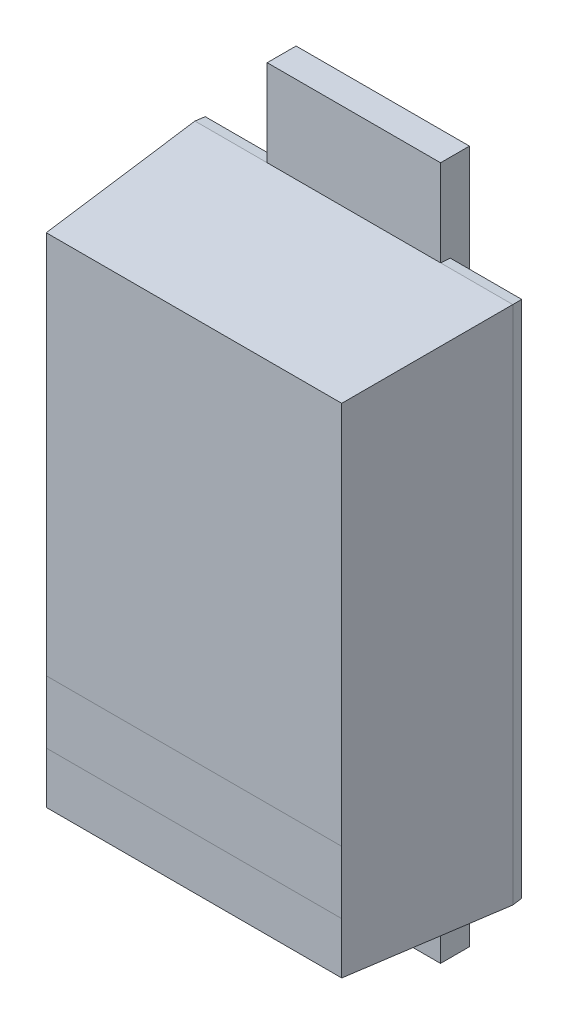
ISO-10303-21;
HEADER;
FILE_DESCRIPTION(('STEP AP214'),'2;1');
FILE_NAME('part.step','',(''),(''),'','','');
FILE_SCHEMA(('AUTOMOTIVE_DESIGN { 1 0 10303 214 1 1 1 1 }'));
ENDSEC;
DATA;
#1=APPLICATION_CONTEXT('core data for automotive mechanical design processes');
#2=APPLICATION_PROTOCOL_DEFINITION('international standard','automotive_design',2000,#1);
#3=PRODUCT_CONTEXT('',#1,'mechanical');
#4=PRODUCT('Part','Part','',(#3));
#5=PRODUCT_RELATED_PRODUCT_CATEGORY('part','',(#4));
#6=PRODUCT_DEFINITION_FORMATION('','',#4);
#7=PRODUCT_DEFINITION_CONTEXT('part definition',#1,'design');
#8=PRODUCT_DEFINITION('design','',#6,#7);
#9=PRODUCT_DEFINITION_SHAPE('','',#8);
#10=(LENGTH_UNIT() NAMED_UNIT(*) SI_UNIT(.MILLI.,.METRE.));
#11=(NAMED_UNIT(*) PLANE_ANGLE_UNIT() SI_UNIT($,.RADIAN.));
#12=(NAMED_UNIT(*) SI_UNIT($,.STERADIAN.) SOLID_ANGLE_UNIT());
#13=UNCERTAINTY_MEASURE_WITH_UNIT(LENGTH_MEASURE(1.E-05),#10,'distance_accuracy_value','');
#14=(GEOMETRIC_REPRESENTATION_CONTEXT(3) GLOBAL_UNCERTAINTY_ASSIGNED_CONTEXT((#13)) GLOBAL_UNIT_ASSIGNED_CONTEXT((#10,
#11,#12)) REPRESENTATION_CONTEXT('',''));
#15=CARTESIAN_POINT('',(0.,0.,0.));
#16=DIRECTION('',(0.,0.,1.));
#17=DIRECTION('',(1.,0.,0.));
#18=AXIS2_PLACEMENT_3D('',#15,#16,#17);
#19=CARTESIAN_POINT('',(16.5001000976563,44.4,0.93));
#20=DIRECTION('',(0.,0.,1.));
#21=DIRECTION('',(1.,0.,0.));
#22=AXIS2_PLACEMENT_3D('',#19,#20,#21);
#23=PLANE('',#22);
#24=DIRECTION('',(-1.,0.,0.));
#25=VECTOR('',#24,1.);
#26=CARTESIAN_POINT('',(15.7331393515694,43.7,0.93));
#27=LINE('',#26,#25);
#28=CARTESIAN_POINT('',(17.2670608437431,43.7,0.93));
#29=VERTEX_POINT('',#28);
#30=CARTESIAN_POINT('',(15.7331393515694,43.7,0.93));
#31=VERTEX_POINT('',#30);
#32=EDGE_CURVE('P0_E161',#29,#31,#27,.T.);
#33=ORIENTED_EDGE('',*,*,#32,.T.);
#34=DIRECTION('',(0.,1.,0.));
#35=VECTOR('',#34,1.);
#36=CARTESIAN_POINT('',(15.7331393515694,44.4,0.93));
#37=LINE('',#36,#35);
#38=CARTESIAN_POINT('',(15.7331393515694,43.375,0.93));
#39=VERTEX_POINT('',#38);
#40=EDGE_CURVE('P0_E148',#31,#39,#37,.F.);
#41=ORIENTED_EDGE('',*,*,#40,.T.);
#42=DIRECTION('',(1.,0.,0.));
#43=VECTOR('',#42,1.);
#44=CARTESIAN_POINT('',(15.7331393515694,43.375,0.93));
#45=LINE('',#44,#43);
#46=CARTESIAN_POINT('',(17.2670608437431,43.375,0.93));
#47=VERTEX_POINT('',#46);
#48=EDGE_CURVE('P0_E156',#39,#47,#45,.T.);
#49=ORIENTED_EDGE('',*,*,#48,.T.);
#50=DIRECTION('',(0.,1.,0.));
#51=VECTOR('',#50,1.);
#52=CARTESIAN_POINT('',(17.2670608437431,44.4,0.93));
#53=LINE('',#52,#51);
#54=EDGE_CURVE('P0_E20',#47,#29,#53,.T.);
#55=ORIENTED_EDGE('',*,*,#54,.T.);
#56=EDGE_LOOP('',(#33,#41,#49,#55));
#57=FACE_BOUND('',#56,.T.);
#58=ADVANCED_FACE('P0_F17',(#57),#23,.T.);
#59=CARTESIAN_POINT('',(15.7331393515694,43.375,0.93));
#60=DIRECTION('',(0.,-1.,0.));
#61=DIRECTION('',(1.,0.,0.));
#62=AXIS2_PLACEMENT_3D('',#59,#60,#61);
#63=PLANE('',#62);
#64=DIRECTION('',(0.,0.,1.));
#65=VECTOR('',#64,1.);
#66=CARTESIAN_POINT('',(17.2670608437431,43.375,0.93));
#67=LINE('',#66,#65);
#68=CARTESIAN_POINT('',(17.2670608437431,43.375,0.980000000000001));
#69=VERTEX_POINT('',#68);
#70=EDGE_CURVE('P0_E164',#47,#69,#67,.T.);
#71=ORIENTED_EDGE('',*,*,#70,.F.);
#72=ORIENTED_EDGE('',*,*,#48,.F.);
#73=DIRECTION('',(0.,0.,1.));
#74=VECTOR('',#73,1.);
#75=CARTESIAN_POINT('',(15.7331393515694,43.375,0.93));
#76=LINE('',#75,#74);
#77=CARTESIAN_POINT('',(15.7331393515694,43.375,0.98));
#78=VERTEX_POINT('',#77);
#79=EDGE_CURVE('P0_E144',#78,#39,#76,.F.);
#80=ORIENTED_EDGE('',*,*,#79,.F.);
#81=DIRECTION('',(-1.,0.,0.));
#82=VECTOR('',#81,1.);
#83=CARTESIAN_POINT('',(17.3251000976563,43.375,0.98));
#84=LINE('',#83,#82);
#85=EDGE_CURVE('P0_E173',#78,#69,#84,.F.);
#86=ORIENTED_EDGE('',*,*,#85,.T.);
#87=EDGE_LOOP('',(#71,#72,#80,#86));
#88=FACE_BOUND('',#87,.T.);
#89=ADVANCED_FACE('P0_F163',(#88),#63,.F.);
#90=CARTESIAN_POINT('',(15.7331393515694,43.7,0.93));
#91=DIRECTION('',(0.,1.,0.));
#92=DIRECTION('',(-1.,0.,0.));
#93=AXIS2_PLACEMENT_3D('',#90,#91,#92);
#94=PLANE('',#93);
#95=DIRECTION('',(0.,0.,1.));
#96=VECTOR('',#95,1.);
#97=CARTESIAN_POINT('',(15.7331393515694,43.7,0.93));
#98=LINE('',#97,#96);
#99=CARTESIAN_POINT('',(15.7331393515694,43.7,0.98));
#100=VERTEX_POINT('',#99);
#101=EDGE_CURVE('P0_E177',#100,#31,#98,.F.);
#102=ORIENTED_EDGE('',*,*,#101,.T.);
#103=ORIENTED_EDGE('',*,*,#32,.F.);
#104=DIRECTION('',(0.,0.,1.));
#105=VECTOR('',#104,1.);
#106=CARTESIAN_POINT('',(17.2670608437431,43.7,0.93));
#107=LINE('',#106,#105);
#108=CARTESIAN_POINT('',(17.2670608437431,43.7,0.980000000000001));
#109=VERTEX_POINT('',#108);
#110=EDGE_CURVE('P0_E166',#109,#29,#107,.F.);
#111=ORIENTED_EDGE('',*,*,#110,.F.);
#112=DIRECTION('',(-1.,0.,0.));
#113=VECTOR('',#112,1.);
#114=CARTESIAN_POINT('',(17.3251000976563,43.7,0.98));
#115=LINE('',#114,#113);
#116=EDGE_CURVE('P0_E185',#109,#100,#115,.T.);
#117=ORIENTED_EDGE('',*,*,#116,.T.);
#118=EDGE_LOOP('',(#102,#103,#111,#117));
#119=FACE_BOUND('',#118,.T.);
#120=ADVANCED_FACE('P0_F375',(#119),#94,.F.);
#121=CARTESIAN_POINT('',(17.3251000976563,43.05,0.98));
#122=DIRECTION('',(0.,0.,-1.));
#123=DIRECTION('',(-1.,0.,0.));
#124=AXIS2_PLACEMENT_3D('',#121,#122,#123);
#125=PLANE('',#124);
#126=ORIENTED_EDGE('',*,*,#85,.F.);
#127=DIRECTION('',(0.,1.,0.));
#128=VECTOR('',#127,1.);
#129=CARTESIAN_POINT('',(15.7331393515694,43.05,0.98));
#130=LINE('',#129,#128);
#131=CARTESIAN_POINT('',(15.7331393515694,43.1080392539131,0.98));
#132=VERTEX_POINT('',#131);
#133=EDGE_CURVE('P0_E171',#132,#78,#130,.T.);
#134=ORIENTED_EDGE('',*,*,#133,.F.);
#135=DIRECTION('',(1.,0.,0.));
#136=VECTOR('',#135,1.);
#137=CARTESIAN_POINT('',(17.3251000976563,43.1080392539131,0.979999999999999));
#138=LINE('',#137,#136);
#139=CARTESIAN_POINT('',(17.2670608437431,43.1080392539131,0.980000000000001));
#140=VERTEX_POINT('',#139);
#141=EDGE_CURVE('P0_E187',#132,#140,#138,.T.);
#142=ORIENTED_EDGE('',*,*,#141,.T.);
#143=DIRECTION('',(0.,1.,0.));
#144=VECTOR('',#143,1.);
#145=CARTESIAN_POINT('',(17.2670608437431,43.05,0.98));
#146=LINE('',#145,#144);
#147=EDGE_CURVE('P0_E175',#69,#140,#146,.F.);
#148=ORIENTED_EDGE('',*,*,#147,.F.);
#149=EDGE_LOOP('',(#126,#134,#142,#148));
#150=FACE_BOUND('',#149,.T.);
#151=ADVANCED_FACE('P0_F373',(#150),#125,.F.);
#152=CARTESIAN_POINT('',(15.7331393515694,43.375,0.93));
#153=DIRECTION('',(-1.,0.,0.));
#154=DIRECTION('',(0.,0.,1.));
#155=AXIS2_PLACEMENT_3D('',#152,#153,#154);
#156=PLANE('',#155);
#157=ORIENTED_EDGE('',*,*,#79,.T.);
#158=ORIENTED_EDGE('',*,*,#40,.F.);
#159=ORIENTED_EDGE('',*,*,#101,.F.);
#160=DIRECTION('',(0.,1.,0.));
#161=VECTOR('',#160,1.);
#162=CARTESIAN_POINT('',(15.7331393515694,43.05,0.98));
#163=LINE('',#162,#161);
#164=EDGE_CURVE('P0_E151',#100,#78,#163,.F.);
#165=ORIENTED_EDGE('',*,*,#164,.T.);
#166=EDGE_LOOP('',(#157,#158,#159,#165));
#167=FACE_BOUND('',#166,.T.);
#168=ADVANCED_FACE('P0_F146',(#167),#156,.F.);
#169=CARTESIAN_POINT('',(17.3251000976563,45.6919607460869,0.98));
#170=DIRECTION('',(0.,-0.997564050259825,-0.0697564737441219));
#171=DIRECTION('',(0.,0.0697564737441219,-0.997564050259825));
#172=AXIS2_PLACEMENT_3D('',#169,#170,#171);
#173=PLANE('',#172);
#174=DIRECTION('',(1.,0.,0.));
#175=VECTOR('',#174,1.);
#176=CARTESIAN_POINT('',(17.3251000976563,45.75,0.14999999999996));
#177=LINE('',#176,#175);
#178=CARTESIAN_POINT('',(16.9501000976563,45.75,0.149999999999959));
#179=VERTEX_POINT('',#178);
#180=CARTESIAN_POINT('',(17.3251000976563,45.75,0.14999999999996));
#181=VERTEX_POINT('',#180);
#182=EDGE_CURVE('P0_E181',#179,#181,#177,.T.);
#183=ORIENTED_EDGE('',*,*,#182,.F.);
#184=DIRECTION('',(1.,0.,0.));
#185=VECTOR('',#184,1.);
#186=CARTESIAN_POINT('',(16.5001000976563,45.75,0.149999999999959));
#187=LINE('',#186,#185);
#188=CARTESIAN_POINT('',(16.0501000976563,45.75,0.149999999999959));
#189=VERTEX_POINT('',#188);
#190=EDGE_CURVE('P0_E203',#179,#189,#187,.F.);
#191=ORIENTED_EDGE('',*,*,#190,.T.);
#192=DIRECTION('',(1.,0.,0.));
#193=VECTOR('',#192,1.);
#194=CARTESIAN_POINT('',(17.3251000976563,45.75,0.149999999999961));
#195=LINE('',#194,#193);
#196=CARTESIAN_POINT('',(15.6751000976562,45.75,0.149999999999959));
#197=VERTEX_POINT('',#196);
#198=EDGE_CURVE('P0_E179',#197,#189,#195,.T.);
#199=ORIENTED_EDGE('',*,*,#198,.F.);
#200=DIRECTION('',(0.0695873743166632,-0.0695873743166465,0.99514581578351));
#201=VECTOR('',#200,1.);
#202=CARTESIAN_POINT('',(15.6751000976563,45.75,0.149999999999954));
#203=LINE('',#202,#201);
#204=CARTESIAN_POINT('',(15.7331393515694,45.6919607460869,0.98));
#205=VERTEX_POINT('',#204);
#206=EDGE_CURVE('P0_E194',#197,#205,#203,.T.);
#207=ORIENTED_EDGE('',*,*,#206,.T.);
#208=DIRECTION('',(-1.,0.,0.));
#209=VECTOR('',#208,1.);
#210=CARTESIAN_POINT('',(17.3251000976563,45.6919607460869,0.98));
#211=LINE('',#210,#209);
#212=CARTESIAN_POINT('',(17.2670608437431,45.6919607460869,0.980000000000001));
#213=VERTEX_POINT('',#212);
#214=EDGE_CURVE('P0_E183',#205,#213,#211,.F.);
#215=ORIENTED_EDGE('',*,*,#214,.T.);
#216=DIRECTION('',(-0.0695873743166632,-0.0695873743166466,0.99514581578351));
#217=VECTOR('',#216,1.);
#218=CARTESIAN_POINT('',(17.3251000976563,45.75,0.14999999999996));
#219=LINE('',#218,#217);
#220=EDGE_CURVE('P0_E209',#181,#213,#219,.T.);
#221=ORIENTED_EDGE('',*,*,#220,.F.);
#222=EDGE_LOOP('',(#183,#191,#199,#207,#215,#221));
#223=FACE_BOUND('',#222,.T.);
#224=ADVANCED_FACE('P0_F367',(#223),#173,.F.);
#225=CARTESIAN_POINT('',(17.3251000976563,43.05,0.98));
#226=DIRECTION('',(0.,0.,-1.));
#227=DIRECTION('',(-1.,0.,0.));
#228=AXIS2_PLACEMENT_3D('',#225,#226,#227);
#229=PLANE('',#228);
#230=ORIENTED_EDGE('',*,*,#116,.F.);
#231=DIRECTION('',(0.,1.,0.));
#232=VECTOR('',#231,1.);
#233=CARTESIAN_POINT('',(17.2670608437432,44.4,0.980000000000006));
#234=LINE('',#233,#232);
#235=EDGE_CURVE('P0_E212',#213,#109,#234,.F.);
#236=ORIENTED_EDGE('',*,*,#235,.F.);
#237=ORIENTED_EDGE('',*,*,#214,.F.);
#238=DIRECTION('',(0.,1.,0.));
#239=VECTOR('',#238,1.);
#240=CARTESIAN_POINT('',(15.7331393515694,43.05,0.98));
#241=LINE('',#240,#239);
#242=EDGE_CURVE('P0_E196',#205,#100,#241,.F.);
#243=ORIENTED_EDGE('',*,*,#242,.T.);
#244=EDGE_LOOP('',(#230,#236,#237,#243));
#245=FACE_BOUND('',#244,.T.);
#246=ADVANCED_FACE('P0_F371',(#245),#229,.F.);
#247=CARTESIAN_POINT('',(17.2670608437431,43.375,0.93));
#248=DIRECTION('',(1.,0.,0.));
#249=DIRECTION('',(0.,0.,-1.));
#250=AXIS2_PLACEMENT_3D('',#247,#248,#249);
#251=PLANE('',#250);
#252=ORIENTED_EDGE('',*,*,#110,.T.);
#253=ORIENTED_EDGE('',*,*,#54,.F.);
#254=ORIENTED_EDGE('',*,*,#70,.T.);
#255=DIRECTION('',(0.,1.,0.));
#256=VECTOR('',#255,1.);
#257=CARTESIAN_POINT('',(17.2670608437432,44.4,0.980000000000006));
#258=LINE('',#257,#256);
#259=EDGE_CURVE('P0_E215',#109,#69,#258,.F.);
#260=ORIENTED_EDGE('',*,*,#259,.F.);
#261=EDGE_LOOP('',(#252,#253,#254,#260));
#262=FACE_BOUND('',#261,.T.);
#263=ADVANCED_FACE('P0_F426',(#262),#251,.F.);
#264=CARTESIAN_POINT('',(17.3251000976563,43.05,0.14999999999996));
#265=DIRECTION('',(0.,0.997564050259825,-0.0697564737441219));
#266=DIRECTION('',(0.,0.0697564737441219,0.997564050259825));
#267=AXIS2_PLACEMENT_3D('',#264,#265,#266);
#268=PLANE('',#267);
#269=DIRECTION('',(1.,0.,0.));
#270=VECTOR('',#269,1.);
#271=CARTESIAN_POINT('',(17.3251000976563,43.05,0.14999999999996));
#272=LINE('',#271,#270);
#273=CARTESIAN_POINT('',(16.0501000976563,43.05,0.14999999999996));
#274=VERTEX_POINT('',#273);
#275=CARTESIAN_POINT('',(15.6751000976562,43.05,0.149999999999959));
#276=VERTEX_POINT('',#275);
#277=EDGE_CURVE('P0_E192',#274,#276,#272,.F.);
#278=ORIENTED_EDGE('',*,*,#277,.F.);
#279=DIRECTION('',(1.,0.,0.));
#280=VECTOR('',#279,1.);
#281=CARTESIAN_POINT('',(16.5001000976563,43.05,0.149999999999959));
#282=LINE('',#281,#280);
#283=CARTESIAN_POINT('',(16.9501000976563,43.05,0.14999999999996));
#284=VERTEX_POINT('',#283);
#285=EDGE_CURVE('P0_E218',#274,#284,#282,.T.);
#286=ORIENTED_EDGE('',*,*,#285,.T.);
#287=DIRECTION('',(1.,0.,0.));
#288=VECTOR('',#287,1.);
#289=CARTESIAN_POINT('',(17.3251000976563,43.05,0.149999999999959));
#290=LINE('',#289,#288);
#291=CARTESIAN_POINT('',(17.3251000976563,43.05,0.149999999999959));
#292=VERTEX_POINT('',#291);
#293=EDGE_CURVE('P0_E190',#292,#284,#290,.F.);
#294=ORIENTED_EDGE('',*,*,#293,.F.);
#295=DIRECTION('',(0.0695873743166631,-0.0695873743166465,-0.99514581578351));
#296=VECTOR('',#295,1.);
#297=CARTESIAN_POINT('',(17.2670608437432,43.1080392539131,0.980000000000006));
#298=LINE('',#297,#296);
#299=EDGE_CURVE('P0_E206',#140,#292,#298,.T.);
#300=ORIENTED_EDGE('',*,*,#299,.F.);
#301=ORIENTED_EDGE('',*,*,#141,.F.);
#302=DIRECTION('',(-0.0695873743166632,-0.0695873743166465,-0.99514581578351));
#303=VECTOR('',#302,1.);
#304=CARTESIAN_POINT('',(15.7331393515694,43.1080392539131,0.98));
#305=LINE('',#304,#303);
#306=EDGE_CURVE('P0_E200',#132,#276,#305,.T.);
#307=ORIENTED_EDGE('',*,*,#306,.T.);
#308=EDGE_LOOP('',(#278,#286,#294,#300,#301,#307));
#309=FACE_BOUND('',#308,.T.);
#310=ADVANCED_FACE('P0_F308',(#309),#268,.F.);
#311=CARTESIAN_POINT('',(15.7331393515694,43.05,0.98));
#312=DIRECTION('',(0.997564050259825,0.,-0.0697564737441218));
#313=DIRECTION('',(-0.0697564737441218,0.,-0.997564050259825));
#314=AXIS2_PLACEMENT_3D('',#311,#312,#313);
#315=PLANE('',#314);
#316=ORIENTED_EDGE('',*,*,#133,.T.);
#317=ORIENTED_EDGE('',*,*,#164,.F.);
#318=ORIENTED_EDGE('',*,*,#242,.F.);
#319=ORIENTED_EDGE('',*,*,#206,.F.);
#320=DIRECTION('',(0.,1.,0.));
#321=VECTOR('',#320,1.);
#322=CARTESIAN_POINT('',(15.6751000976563,43.05,0.149999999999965));
#323=LINE('',#322,#321);
#324=EDGE_CURVE('P0_E225',#197,#276,#323,.F.);
#325=ORIENTED_EDGE('',*,*,#324,.T.);
#326=ORIENTED_EDGE('',*,*,#306,.F.);
#327=EDGE_LOOP('',(#316,#317,#318,#319,#325,#326));
#328=FACE_BOUND('',#327,.T.);
#329=ADVANCED_FACE('P0_F362',(#328),#315,.F.);
#330=CARTESIAN_POINT('',(16.5001000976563,44.4,0.149999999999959));
#331=DIRECTION('',(0.,0.,1.));
#332=DIRECTION('',(0.,-1.,0.));
#333=AXIS2_PLACEMENT_3D('',#330,#331,#332);
#334=PLANE('',#333);
#335=DIRECTION('',(1.,0.,0.));
#336=VECTOR('',#335,1.);
#337=CARTESIAN_POINT('',(16.9501000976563,45.45,0.149999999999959));
#338=LINE('',#337,#336);
#339=CARTESIAN_POINT('',(16.9501000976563,45.45,0.149999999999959));
#340=VERTEX_POINT('',#339);
#341=CARTESIAN_POINT('',(16.0501000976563,45.45,0.149999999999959));
#342=VERTEX_POINT('',#341);
#343=EDGE_CURVE('P0_E237',#340,#342,#338,.F.);
#344=ORIENTED_EDGE('',*,*,#343,.T.);
#345=DIRECTION('',(0.,-1.,0.));
#346=VECTOR('',#345,1.);
#347=CARTESIAN_POINT('',(16.0501000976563,45.45,0.149999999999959));
#348=LINE('',#347,#346);
#349=EDGE_CURVE('P0_E232',#342,#189,#348,.F.);
#350=ORIENTED_EDGE('',*,*,#349,.T.);
#351=ORIENTED_EDGE('',*,*,#190,.F.);
#352=DIRECTION('',(0.,1.,0.));
#353=VECTOR('',#352,1.);
#354=CARTESIAN_POINT('',(16.9501000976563,45.45,0.149999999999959));
#355=LINE('',#354,#353);
#356=EDGE_CURVE('P0_E241',#179,#340,#355,.F.);
#357=ORIENTED_EDGE('',*,*,#356,.T.);
#358=EDGE_LOOP('',(#344,#350,#351,#357));
#359=FACE_BOUND('',#358,.T.);
#360=ADVANCED_FACE('P0_F418',(#359),#334,.F.);
#361=CARTESIAN_POINT('',(17.3251000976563,44.4,0.14999999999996));
#362=DIRECTION('',(0.997564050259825,0.,0.0697564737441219));
#363=DIRECTION('',(0.0697564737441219,0.,-0.997564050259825));
#364=AXIS2_PLACEMENT_3D('',#361,#362,#363);
#365=PLANE('',#364);
#366=ORIENTED_EDGE('',*,*,#259,.T.);
#367=ORIENTED_EDGE('',*,*,#147,.T.);
#368=ORIENTED_EDGE('',*,*,#299,.T.);
#369=DIRECTION('',(0.,1.,0.));
#370=VECTOR('',#369,1.);
#371=CARTESIAN_POINT('',(17.3251000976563,44.4,0.14999999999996));
#372=LINE('',#371,#370);
#373=EDGE_CURVE('P0_E250',#181,#292,#372,.F.);
#374=ORIENTED_EDGE('',*,*,#373,.F.);
#375=ORIENTED_EDGE('',*,*,#220,.T.);
#376=ORIENTED_EDGE('',*,*,#235,.T.);
#377=EDGE_LOOP('',(#366,#367,#368,#374,#375,#376));
#378=FACE_BOUND('',#377,.T.);
#379=ADVANCED_FACE('P0_F356',(#378),#365,.T.);
#380=CARTESIAN_POINT('',(16.5001000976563,44.4,0.149999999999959));
#381=DIRECTION('',(0.,0.,1.));
#382=DIRECTION('',(0.,-1.,0.));
#383=AXIS2_PLACEMENT_3D('',#380,#381,#382);
#384=PLANE('',#383);
#385=DIRECTION('',(0.,1.,0.));
#386=VECTOR('',#385,1.);
#387=CARTESIAN_POINT('',(16.9501000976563,43.35,0.14999999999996));
#388=LINE('',#387,#386);
#389=CARTESIAN_POINT('',(16.9501000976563,43.35,0.149999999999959));
#390=VERTEX_POINT('',#389);
#391=EDGE_CURVE('P0_E255',#390,#284,#388,.F.);
#392=ORIENTED_EDGE('',*,*,#391,.T.);
#393=ORIENTED_EDGE('',*,*,#285,.F.);
#394=DIRECTION('',(0.,-1.,0.));
#395=VECTOR('',#394,1.);
#396=CARTESIAN_POINT('',(16.0501000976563,43.35,0.14999999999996));
#397=LINE('',#396,#395);
#398=CARTESIAN_POINT('',(16.0501000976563,43.35,0.14999999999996));
#399=VERTEX_POINT('',#398);
#400=EDGE_CURVE('P0_E221',#274,#399,#397,.F.);
#401=ORIENTED_EDGE('',*,*,#400,.T.);
#402=DIRECTION('',(1.,0.,0.));
#403=VECTOR('',#402,1.);
#404=CARTESIAN_POINT('',(16.9501000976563,43.35,0.149999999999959));
#405=LINE('',#404,#403);
#406=EDGE_CURVE('P0_E263',#399,#390,#405,.T.);
#407=ORIENTED_EDGE('',*,*,#406,.T.);
#408=EDGE_LOOP('',(#392,#393,#401,#407));
#409=FACE_BOUND('',#408,.T.);
#410=ADVANCED_FACE('P0_F311',(#409),#384,.F.);
#411=CARTESIAN_POINT('',(16.0501000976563,43.35,0.149999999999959));
#412=DIRECTION('',(-1.,0.,0.));
#413=DIRECTION('',(0.,-1.,0.));
#414=AXIS2_PLACEMENT_3D('',#411,#412,#413);
#415=PLANE('',#414);
#416=DIRECTION('',(0.,1.,0.));
#417=VECTOR('',#416,1.);
#418=CARTESIAN_POINT('',(16.0501000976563,44.4,0.1));
#419=LINE('',#418,#417);
#420=CARTESIAN_POINT('',(16.0501000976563,43.35,0.1));
#421=VERTEX_POINT('',#420);
#422=CARTESIAN_POINT('',(16.0501000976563,43.0534963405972,0.099999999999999));
#423=VERTEX_POINT('',#422);
#424=EDGE_CURVE('P0_E266',#421,#423,#419,.F.);
#425=ORIENTED_EDGE('',*,*,#424,.F.);
#426=DIRECTION('',(0.,0.,1.));
#427=VECTOR('',#426,1.);
#428=CARTESIAN_POINT('',(16.0501000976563,43.35,0.14999999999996));
#429=LINE('',#428,#427);
#430=EDGE_CURVE('P0_E260',#421,#399,#429,.T.);
#431=ORIENTED_EDGE('',*,*,#430,.T.);
#432=ORIENTED_EDGE('',*,*,#400,.F.);
#433=DIRECTION('',(0.,-0.069756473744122,0.997564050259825));
#434=VECTOR('',#433,1.);
#435=CARTESIAN_POINT('',(16.0501000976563,43.0604890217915,0.));
#436=LINE('',#435,#434);
#437=EDGE_CURVE('P0_E223',#274,#423,#436,.F.);
#438=ORIENTED_EDGE('',*,*,#437,.T.);
#439=EDGE_LOOP('',(#425,#431,#432,#438));
#440=FACE_BOUND('',#439,.T.);
#441=ADVANCED_FACE('P0_F317',(#440),#415,.F.);
#442=CARTESIAN_POINT('',(17.3251000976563,43.0604890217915,0.));
#443=DIRECTION('',(0.,0.997564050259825,0.069756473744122));
#444=DIRECTION('',(0.,-0.069756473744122,0.997564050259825));
#445=AXIS2_PLACEMENT_3D('',#442,#443,#444);
#446=PLANE('',#445);
#447=ORIENTED_EDGE('',*,*,#277,.T.);
#448=DIRECTION('',(0.0695873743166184,0.0695873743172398,-0.995145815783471));
#449=VECTOR('',#448,1.);
#450=CARTESIAN_POINT('',(15.6751000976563,43.05,0.149999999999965));
#451=LINE('',#450,#449);
#452=CARTESIAN_POINT('',(15.6785964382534,43.0534963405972,0.099999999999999));
#453=VERTEX_POINT('',#452);
#454=EDGE_CURVE('P0_E228',#276,#453,#451,.T.);
#455=ORIENTED_EDGE('',*,*,#454,.T.);
#456=DIRECTION('',(-1.,0.,0.));
#457=VECTOR('',#456,1.);
#458=CARTESIAN_POINT('',(16.5001000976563,43.0534963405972,0.1));
#459=LINE('',#458,#457);
#460=EDGE_CURVE('P0_E269',#423,#453,#459,.T.);
#461=ORIENTED_EDGE('',*,*,#460,.F.);
#462=ORIENTED_EDGE('',*,*,#437,.F.);
#463=EDGE_LOOP('',(#447,#455,#461,#462));
#464=FACE_BOUND('',#463,.T.);
#465=ADVANCED_FACE('P0_F322',(#464),#446,.F.);
#466=CARTESIAN_POINT('',(15.6855891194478,43.05,0.));
#467=DIRECTION('',(0.997564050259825,0.,0.0697564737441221));
#468=DIRECTION('',(0.0697564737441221,0.,-0.997564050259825));
#469=AXIS2_PLACEMENT_3D('',#466,#467,#468);
#470=PLANE('',#469);
#471=DIRECTION('',(0.,1.,0.));
#472=VECTOR('',#471,1.);
#473=CARTESIAN_POINT('',(15.6785964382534,44.4,0.1));
#474=LINE('',#473,#472);
#475=CARTESIAN_POINT('',(15.6785964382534,45.7465036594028,0.100000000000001));
#476=VERTEX_POINT('',#475);
#477=EDGE_CURVE('P0_E272',#453,#476,#474,.T.);
#478=ORIENTED_EDGE('',*,*,#477,.F.);
#479=ORIENTED_EDGE('',*,*,#454,.F.);
#480=ORIENTED_EDGE('',*,*,#324,.F.);
#481=DIRECTION('',(0.0695873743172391,-0.0695873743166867,-0.995145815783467));
#482=VECTOR('',#481,1.);
#483=CARTESIAN_POINT('',(15.6751000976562,45.75,0.14999999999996));
#484=LINE('',#483,#482);
#485=EDGE_CURVE('P0_E230',#197,#476,#484,.T.);
#486=ORIENTED_EDGE('',*,*,#485,.T.);
#487=EDGE_LOOP('',(#478,#479,#480,#486));
#488=FACE_BOUND('',#487,.T.);
#489=ADVANCED_FACE('P0_F326',(#488),#470,.F.);
#490=CARTESIAN_POINT('',(17.3251000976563,45.75,0.15000000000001));
#491=DIRECTION('',(0.,-0.997564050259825,0.0697564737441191));
#492=DIRECTION('',(0.,-0.0697564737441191,-0.997564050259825));
#493=AXIS2_PLACEMENT_3D('',#490,#491,#492);
#494=PLANE('',#493);
#495=DIRECTION('',(-1.,0.,0.));
#496=VECTOR('',#495,1.);
#497=CARTESIAN_POINT('',(16.5001000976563,45.7465036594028,0.1));
#498=LINE('',#497,#496);
#499=CARTESIAN_POINT('',(16.0501000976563,45.7465036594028,0.0999999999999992));
#500=VERTEX_POINT('',#499);
#501=EDGE_CURVE('P0_E275',#476,#500,#498,.F.);
#502=ORIENTED_EDGE('',*,*,#501,.F.);
#503=ORIENTED_EDGE('',*,*,#485,.F.);
#504=ORIENTED_EDGE('',*,*,#198,.T.);
#505=DIRECTION('',(0.,-0.0697564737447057,-0.997564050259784));
#506=VECTOR('',#505,1.);
#507=CARTESIAN_POINT('',(16.0501000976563,45.75,0.149999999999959));
#508=LINE('',#507,#506);
#509=EDGE_CURVE('P0_E235',#189,#500,#508,.T.);
#510=ORIENTED_EDGE('',*,*,#509,.T.);
#511=EDGE_LOOP('',(#502,#503,#504,#510));
#512=FACE_BOUND('',#511,.T.);
#513=ADVANCED_FACE('P0_F330',(#512),#494,.F.);
#514=CARTESIAN_POINT('',(16.0501000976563,45.45,0.149999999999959));
#515=DIRECTION('',(-1.,0.,0.));
#516=DIRECTION('',(0.,-1.,0.));
#517=AXIS2_PLACEMENT_3D('',#514,#515,#516);
#518=PLANE('',#517);
#519=ORIENTED_EDGE('',*,*,#349,.F.);
#520=DIRECTION('',(0.,0.,-1.));
#521=VECTOR('',#520,1.);
#522=CARTESIAN_POINT('',(16.0501000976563,45.45,0.149999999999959));
#523=LINE('',#522,#521);
#524=CARTESIAN_POINT('',(16.0501000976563,45.45,0.1));
#525=VERTEX_POINT('',#524);
#526=EDGE_CURVE('P0_E239',#342,#525,#523,.T.);
#527=ORIENTED_EDGE('',*,*,#526,.T.);
#528=DIRECTION('',(0.,1.,0.));
#529=VECTOR('',#528,1.);
#530=CARTESIAN_POINT('',(16.0501000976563,44.4,0.1));
#531=LINE('',#530,#529);
#532=EDGE_CURVE('P0_E278',#500,#525,#531,.F.);
#533=ORIENTED_EDGE('',*,*,#532,.F.);
#534=ORIENTED_EDGE('',*,*,#509,.F.);
#535=EDGE_LOOP('',(#519,#527,#533,#534));
#536=FACE_BOUND('',#535,.T.);
#537=ADVANCED_FACE('P0_F336',(#536),#518,.F.);
#538=CARTESIAN_POINT('',(16.9501000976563,45.45,0.149999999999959));
#539=DIRECTION('',(0.,-1.,0.));
#540=DIRECTION('',(0.,0.,-1.));
#541=AXIS2_PLACEMENT_3D('',#538,#539,#540);
#542=PLANE('',#541);
#543=ORIENTED_EDGE('',*,*,#526,.F.);
#544=ORIENTED_EDGE('',*,*,#343,.F.);
#545=DIRECTION('',(0.,0.,1.));
#546=VECTOR('',#545,1.);
#547=CARTESIAN_POINT('',(16.9501000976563,45.45,0.149999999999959));
#548=LINE('',#547,#546);
#549=CARTESIAN_POINT('',(16.9501000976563,45.45,0.1));
#550=VERTEX_POINT('',#549);
#551=EDGE_CURVE('P0_E243',#340,#550,#548,.F.);
#552=ORIENTED_EDGE('',*,*,#551,.T.);
#553=DIRECTION('',(-1.,0.,0.));
#554=VECTOR('',#553,1.);
#555=CARTESIAN_POINT('',(16.5001000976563,45.45,0.1));
#556=LINE('',#555,#554);
#557=EDGE_CURVE('P0_E281',#525,#550,#556,.F.);
#558=ORIENTED_EDGE('',*,*,#557,.F.);
#559=EDGE_LOOP('',(#543,#544,#552,#558));
#560=FACE_BOUND('',#559,.T.);
#561=ADVANCED_FACE('P0_F340',(#560),#542,.F.);
#562=CARTESIAN_POINT('',(16.9501000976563,45.45,0.149999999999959));
#563=DIRECTION('',(1.,0.,0.));
#564=DIRECTION('',(0.,1.,0.));
#565=AXIS2_PLACEMENT_3D('',#562,#563,#564);
#566=PLANE('',#565);
#567=DIRECTION('',(0.,1.,0.));
#568=VECTOR('',#567,1.);
#569=CARTESIAN_POINT('',(16.9501000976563,44.4,0.1));
#570=LINE('',#569,#568);
#571=CARTESIAN_POINT('',(16.9501000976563,45.7465036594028,0.0999999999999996));
#572=VERTEX_POINT('',#571);
#573=EDGE_CURVE('P0_E284',#550,#572,#570,.T.);
#574=ORIENTED_EDGE('',*,*,#573,.F.);
#575=ORIENTED_EDGE('',*,*,#551,.F.);
#576=ORIENTED_EDGE('',*,*,#356,.F.);
#577=DIRECTION('',(0.,-0.0697564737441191,-0.997564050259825));
#578=VECTOR('',#577,1.);
#579=CARTESIAN_POINT('',(16.9501000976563,45.75,0.15000000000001));
#580=LINE('',#579,#578);
#581=EDGE_CURVE('P0_E245',#179,#572,#580,.T.);
#582=ORIENTED_EDGE('',*,*,#581,.T.);
#583=EDGE_LOOP('',(#574,#575,#576,#582));
#584=FACE_BOUND('',#583,.T.);
#585=ADVANCED_FACE('P0_F345',(#584),#566,.F.);
#586=CARTESIAN_POINT('',(17.3251000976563,45.75,0.15000000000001));
#587=DIRECTION('',(0.,-0.997564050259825,0.0697564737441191));
#588=DIRECTION('',(0.,-0.0697564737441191,-0.997564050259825));
#589=AXIS2_PLACEMENT_3D('',#586,#587,#588);
#590=PLANE('',#589);
#591=ORIENTED_EDGE('',*,*,#182,.T.);
#592=DIRECTION('',(0.0695873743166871,0.0695873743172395,0.995145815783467));
#593=VECTOR('',#592,1.);
#594=CARTESIAN_POINT('',(17.3216037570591,45.7465036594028,0.0999999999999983));
#595=LINE('',#594,#593);
#596=CARTESIAN_POINT('',(17.3216037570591,45.7465036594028,0.0999999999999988));
#597=VERTEX_POINT('',#596);
#598=EDGE_CURVE('P0_E247',#597,#181,#595,.T.);
#599=ORIENTED_EDGE('',*,*,#598,.F.);
#600=DIRECTION('',(-1.,0.,0.));
#601=VECTOR('',#600,1.);
#602=CARTESIAN_POINT('',(16.5001000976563,45.7465036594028,0.1));
#603=LINE('',#602,#601);
#604=EDGE_CURVE('P0_E287',#572,#597,#603,.F.);
#605=ORIENTED_EDGE('',*,*,#604,.F.);
#606=ORIENTED_EDGE('',*,*,#581,.F.);
#607=EDGE_LOOP('',(#591,#599,#605,#606));
#608=FACE_BOUND('',#607,.T.);
#609=ADVANCED_FACE('P0_F350',(#608),#590,.F.);
#610=CARTESIAN_POINT('',(17.3251000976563,44.4,0.15000000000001));
#611=DIRECTION('',(0.997564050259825,0.,-0.069756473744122));
#612=DIRECTION('',(-0.069756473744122,0.,-0.997564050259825));
#613=AXIS2_PLACEMENT_3D('',#610,#611,#612);
#614=PLANE('',#613);
#615=ORIENTED_EDGE('',*,*,#598,.T.);
#616=ORIENTED_EDGE('',*,*,#373,.T.);
#617=DIRECTION('',(-0.0695873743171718,0.0695873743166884,-0.995145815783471));
#618=VECTOR('',#617,1.);
#619=CARTESIAN_POINT('',(17.3251000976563,43.05,0.149999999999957));
#620=LINE('',#619,#618);
#621=CARTESIAN_POINT('',(17.3216037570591,43.0534963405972,0.0999999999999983));
#622=VERTEX_POINT('',#621);
#623=EDGE_CURVE('P0_E253',#292,#622,#620,.T.);
#624=ORIENTED_EDGE('',*,*,#623,.T.);
#625=DIRECTION('',(0.,1.,0.));
#626=VECTOR('',#625,1.);
#627=CARTESIAN_POINT('',(17.3216037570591,44.4,0.1));
#628=LINE('',#627,#626);
#629=EDGE_CURVE('P0_E290',#597,#622,#628,.F.);
#630=ORIENTED_EDGE('',*,*,#629,.F.);
#631=EDGE_LOOP('',(#615,#616,#624,#630));
#632=FACE_BOUND('',#631,.T.);
#633=ADVANCED_FACE('P0_F353',(#632),#614,.T.);
#634=CARTESIAN_POINT('',(17.3251000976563,43.0604890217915,0.));
#635=DIRECTION('',(0.,0.997564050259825,0.069756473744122));
#636=DIRECTION('',(0.,-0.069756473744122,0.997564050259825));
#637=AXIS2_PLACEMENT_3D('',#634,#635,#636);
#638=PLANE('',#637);
#639=DIRECTION('',(-1.,0.,0.));
#640=VECTOR('',#639,1.);
#641=CARTESIAN_POINT('',(16.5001000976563,43.0534963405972,0.1));
#642=LINE('',#641,#640);
#643=CARTESIAN_POINT('',(16.9501000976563,43.0534963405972,0.0999999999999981));
#644=VERTEX_POINT('',#643);
#645=EDGE_CURVE('P0_E293',#622,#644,#642,.T.);
#646=ORIENTED_EDGE('',*,*,#645,.F.);
#647=ORIENTED_EDGE('',*,*,#623,.F.);
#648=ORIENTED_EDGE('',*,*,#293,.T.);
#649=DIRECTION('',(0.,0.0697564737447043,-0.997564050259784));
#650=VECTOR('',#649,1.);
#651=CARTESIAN_POINT('',(16.9501000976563,43.05,0.14999999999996));
#652=LINE('',#651,#650);
#653=EDGE_CURVE('P0_E258',#284,#644,#652,.T.);
#654=ORIENTED_EDGE('',*,*,#653,.T.);
#655=EDGE_LOOP('',(#646,#647,#648,#654));
#656=FACE_BOUND('',#655,.T.);
#657=ADVANCED_FACE('P0_F303',(#656),#638,.F.);
#658=CARTESIAN_POINT('',(16.9501000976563,43.35,0.14999999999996));
#659=DIRECTION('',(1.,0.,0.));
#660=DIRECTION('',(0.,1.,0.));
#661=AXIS2_PLACEMENT_3D('',#658,#659,#660);
#662=PLANE('',#661);
#663=ORIENTED_EDGE('',*,*,#391,.F.);
#664=DIRECTION('',(0.,0.,1.));
#665=VECTOR('',#664,1.);
#666=CARTESIAN_POINT('',(16.9501000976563,43.35,0.14999999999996));
#667=LINE('',#666,#665);
#668=CARTESIAN_POINT('',(16.9501000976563,43.35,0.1));
#669=VERTEX_POINT('',#668);
#670=EDGE_CURVE('P0_E35',#390,#669,#667,.F.);
#671=ORIENTED_EDGE('',*,*,#670,.T.);
#672=DIRECTION('',(0.,1.,0.));
#673=VECTOR('',#672,1.);
#674=CARTESIAN_POINT('',(16.9501000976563,44.4,0.1));
#675=LINE('',#674,#673);
#676=EDGE_CURVE('P0_E26',#644,#669,#675,.T.);
#677=ORIENTED_EDGE('',*,*,#676,.F.);
#678=ORIENTED_EDGE('',*,*,#653,.F.);
#679=EDGE_LOOP('',(#663,#671,#677,#678));
#680=FACE_BOUND('',#679,.T.);
#681=ADVANCED_FACE('P0_F301',(#680),#662,.F.);
#682=CARTESIAN_POINT('',(16.9501000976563,43.35,0.14999999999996));
#683=DIRECTION('',(0.,1.,0.));
#684=DIRECTION('',(0.,0.,1.));
#685=AXIS2_PLACEMENT_3D('',#682,#683,#684);
#686=PLANE('',#685);
#687=ORIENTED_EDGE('',*,*,#670,.F.);
#688=ORIENTED_EDGE('',*,*,#406,.F.);
#689=ORIENTED_EDGE('',*,*,#430,.F.);
#690=DIRECTION('',(-1.,0.,0.));
#691=VECTOR('',#690,1.);
#692=CARTESIAN_POINT('',(16.5001000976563,43.35,0.1));
#693=LINE('',#692,#691);
#694=EDGE_CURVE('P0_E11',#669,#421,#693,.T.);
#695=ORIENTED_EDGE('',*,*,#694,.F.);
#696=EDGE_LOOP('',(#687,#688,#689,#695));
#697=FACE_BOUND('',#696,.T.);
#698=ADVANCED_FACE('P0_F315',(#697),#686,.F.);
#699=CARTESIAN_POINT('',(16.5001000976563,44.4,0.1));
#700=DIRECTION('',(0.,0.,-1.));
#701=DIRECTION('',(-1.,0.,0.));
#702=AXIS2_PLACEMENT_3D('',#699,#700,#701);
#703=PLANE('',#702);
#704=ORIENTED_EDGE('',*,*,#676,.T.);
#705=ORIENTED_EDGE('',*,*,#694,.T.);
#706=ORIENTED_EDGE('',*,*,#424,.T.);
#707=ORIENTED_EDGE('',*,*,#460,.T.);
#708=ORIENTED_EDGE('',*,*,#477,.T.);
#709=ORIENTED_EDGE('',*,*,#501,.T.);
#710=ORIENTED_EDGE('',*,*,#532,.T.);
#711=ORIENTED_EDGE('',*,*,#557,.T.);
#712=ORIENTED_EDGE('',*,*,#573,.T.);
#713=ORIENTED_EDGE('',*,*,#604,.T.);
#714=ORIENTED_EDGE('',*,*,#629,.T.);
#715=ORIENTED_EDGE('',*,*,#645,.T.);
#716=EDGE_LOOP('',(#704,#705,#706,#707,#708,#709,#710,#711,#712,#713,#714,#715));
#717=FACE_BOUND('',#716,.T.);
#718=ADVANCED_FACE('P0_F298',(#717),#703,.T.);
#719=CLOSED_SHELL('',(#58,#89,#120,#151,#168,#224,#246,#263,#310,#329,#360,#379,#410,#441,#465,
#489,#513,#537,#561,#585,#609,#633,#657,#681,#698,#718));
#720=MANIFOLD_SOLID_BREP('P0_B1',#719);
#721=CARTESIAN_POINT('',(16.9501000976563,42.6,0.));
#722=DIRECTION('',(0.,0.,1.));
#723=DIRECTION('',(0.,-1.,0.));
#724=AXIS2_PLACEMENT_3D('',#721,#722,#723);
#725=PLANE('',#724);
#726=DIRECTION('',(1.,0.,0.));
#727=VECTOR('',#726,1.);
#728=CARTESIAN_POINT('',(16.9501000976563,43.35,0.));
#729=LINE('',#728,#727);
#730=CARTESIAN_POINT('',(16.0501000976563,43.35,0.));
#731=VERTEX_POINT('',#730);
#732=CARTESIAN_POINT('',(16.9501000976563,43.35,0.));
#733=VERTEX_POINT('',#732);
#734=EDGE_CURVE('P1_E20',#731,#733,#729,.T.);
#735=ORIENTED_EDGE('',*,*,#734,.T.);
#736=DIRECTION('',(0.,1.,0.));
#737=VECTOR('',#736,1.);
#738=CARTESIAN_POINT('',(16.9501000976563,44.4,0.));
#739=LINE('',#738,#737);
#740=CARTESIAN_POINT('',(16.9501000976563,42.6,0.));
#741=VERTEX_POINT('',#740);
#742=EDGE_CURVE('P1_E55',#741,#733,#739,.T.);
#743=ORIENTED_EDGE('',*,*,#742,.F.);
#744=DIRECTION('',(-1.,0.,0.));
#745=VECTOR('',#744,1.);
#746=CARTESIAN_POINT('',(16.9501000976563,42.6,0.));
#747=LINE('',#746,#745);
#748=CARTESIAN_POINT('',(16.0501000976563,42.6,0.));
#749=VERTEX_POINT('',#748);
#750=EDGE_CURVE('P1_E76',#741,#749,#747,.T.);
#751=ORIENTED_EDGE('',*,*,#750,.T.);
#752=DIRECTION('',(0.,1.,0.));
#753=VECTOR('',#752,1.);
#754=CARTESIAN_POINT('',(16.0501000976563,44.4,0.));
#755=LINE('',#754,#753);
#756=EDGE_CURVE('P1_E58',#749,#731,#755,.T.);
#757=ORIENTED_EDGE('',*,*,#756,.T.);
#758=EDGE_LOOP('',(#735,#743,#751,#757));
#759=FACE_BOUND('',#758,.T.);
#760=ADVANCED_FACE('P1_F17',(#759),#725,.F.);
#761=CARTESIAN_POINT('',(16.9501000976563,43.35,0.));
#762=DIRECTION('',(0.,-1.,0.));
#763=DIRECTION('',(1.,0.,0.));
#764=AXIS2_PLACEMENT_3D('',#761,#762,#763);
#765=PLANE('',#764);
#766=DIRECTION('',(1.,0.,0.));
#767=VECTOR('',#766,1.);
#768=CARTESIAN_POINT('',(16.9501000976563,43.35,0.14999999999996));
#769=LINE('',#768,#767);
#770=CARTESIAN_POINT('',(16.0501000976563,43.35,0.14999999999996));
#771=VERTEX_POINT('',#770);
#772=CARTESIAN_POINT('',(16.9501000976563,43.35,0.14999999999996));
#773=VERTEX_POINT('',#772);
#774=EDGE_CURVE('P1_E73',#771,#773,#769,.T.);
#775=ORIENTED_EDGE('',*,*,#774,.T.);
#776=DIRECTION('',(0.,0.,-1.));
#777=VECTOR('',#776,1.);
#778=CARTESIAN_POINT('',(16.9501000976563,43.35,0.));
#779=LINE('',#778,#777);
#780=EDGE_CURVE('P1_E63',#733,#773,#779,.F.);
#781=ORIENTED_EDGE('',*,*,#780,.F.);
#782=ORIENTED_EDGE('',*,*,#734,.F.);
#783=DIRECTION('',(0.,0.,-1.));
#784=VECTOR('',#783,1.);
#785=CARTESIAN_POINT('',(16.0501000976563,43.35,0.));
#786=LINE('',#785,#784);
#787=EDGE_CURVE('P1_E80',#731,#771,#786,.F.);
#788=ORIENTED_EDGE('',*,*,#787,.T.);
#789=EDGE_LOOP('',(#775,#781,#782,#788));
#790=FACE_BOUND('',#789,.T.);
#791=ADVANCED_FACE('P1_F72',(#790),#765,.F.);
#792=CARTESIAN_POINT('',(16.9501000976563,44.4,0.));
#793=DIRECTION('',(1.,0.,0.));
#794=DIRECTION('',(0.,0.,-1.));
#795=AXIS2_PLACEMENT_3D('',#792,#793,#794);
#796=PLANE('',#795);
#797=DIRECTION('',(0.,0.,1.));
#798=VECTOR('',#797,1.);
#799=CARTESIAN_POINT('',(16.9501000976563,42.6,0.14999999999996));
#800=LINE('',#799,#798);
#801=CARTESIAN_POINT('',(16.9501000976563,42.6,0.14999999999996));
#802=VERTEX_POINT('',#801);
#803=EDGE_CURVE('P1_E69',#802,#741,#800,.F.);
#804=ORIENTED_EDGE('',*,*,#803,.T.);
#805=ORIENTED_EDGE('',*,*,#742,.T.);
#806=ORIENTED_EDGE('',*,*,#780,.T.);
#807=DIRECTION('',(0.,1.,0.));
#808=VECTOR('',#807,1.);
#809=CARTESIAN_POINT('',(16.9501000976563,43.35,0.14999999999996));
#810=LINE('',#809,#808);
#811=EDGE_CURVE('P1_E83',#773,#802,#810,.F.);
#812=ORIENTED_EDGE('',*,*,#811,.T.);
#813=EDGE_LOOP('',(#804,#805,#806,#812));
#814=FACE_BOUND('',#813,.T.);
#815=ADVANCED_FACE('P1_F66',(#814),#796,.T.);
#816=CARTESIAN_POINT('',(16.9501000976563,42.6,0.14999999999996));
#817=DIRECTION('',(0.,1.,0.));
#818=DIRECTION('',(-1.,0.,0.));
#819=AXIS2_PLACEMENT_3D('',#816,#817,#818);
#820=PLANE('',#819);
#821=ORIENTED_EDGE('',*,*,#750,.F.);
#822=ORIENTED_EDGE('',*,*,#803,.F.);
#823=DIRECTION('',(1.,0.,0.));
#824=VECTOR('',#823,1.);
#825=CARTESIAN_POINT('',(16.9501000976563,42.6,0.14999999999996));
#826=LINE('',#825,#824);
#827=CARTESIAN_POINT('',(16.0501000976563,42.6,0.14999999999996));
#828=VERTEX_POINT('',#827);
#829=EDGE_CURVE('P1_E26',#802,#828,#826,.F.);
#830=ORIENTED_EDGE('',*,*,#829,.T.);
#831=DIRECTION('',(0.,0.,-1.));
#832=VECTOR('',#831,1.);
#833=CARTESIAN_POINT('',(16.0501000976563,42.6,0.));
#834=LINE('',#833,#832);
#835=EDGE_CURVE('P1_E34',#828,#749,#834,.T.);
#836=ORIENTED_EDGE('',*,*,#835,.T.);
#837=EDGE_LOOP('',(#821,#822,#830,#836));
#838=FACE_BOUND('',#837,.T.);
#839=ADVANCED_FACE('P1_F88',(#838),#820,.F.);
#840=CARTESIAN_POINT('',(16.0501000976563,44.4,0.));
#841=DIRECTION('',(1.,0.,0.));
#842=DIRECTION('',(0.,0.,-1.));
#843=AXIS2_PLACEMENT_3D('',#840,#841,#842);
#844=PLANE('',#843);
#845=ORIENTED_EDGE('',*,*,#756,.F.);
#846=ORIENTED_EDGE('',*,*,#835,.F.);
#847=DIRECTION('',(0.,1.,0.));
#848=VECTOR('',#847,1.);
#849=CARTESIAN_POINT('',(16.0501000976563,43.35,0.14999999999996));
#850=LINE('',#849,#848);
#851=EDGE_CURVE('P1_E11',#828,#771,#850,.T.);
#852=ORIENTED_EDGE('',*,*,#851,.T.);
#853=ORIENTED_EDGE('',*,*,#787,.F.);
#854=EDGE_LOOP('',(#845,#846,#852,#853));
#855=FACE_BOUND('',#854,.T.);
#856=ADVANCED_FACE('P1_F91',(#855),#844,.F.);
#857=CARTESIAN_POINT('',(16.9501000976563,43.35,0.14999999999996));
#858=DIRECTION('',(0.,0.,-1.));
#859=DIRECTION('',(0.,1.,0.));
#860=AXIS2_PLACEMENT_3D('',#857,#858,#859);
#861=PLANE('',#860);
#862=ORIENTED_EDGE('',*,*,#829,.F.);
#863=ORIENTED_EDGE('',*,*,#811,.F.);
#864=ORIENTED_EDGE('',*,*,#774,.F.);
#865=ORIENTED_EDGE('',*,*,#851,.F.);
#866=EDGE_LOOP('',(#862,#863,#864,#865));
#867=FACE_BOUND('',#866,.T.);
#868=ADVANCED_FACE('P1_F90',(#867),#861,.F.);
#869=CLOSED_SHELL('',(#760,#791,#815,#839,#856,#868));
#870=MANIFOLD_SOLID_BREP('P1_B1',#869);
#871=CARTESIAN_POINT('',(16.5001000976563,44.4,0.93));
#872=DIRECTION('',(0.,0.,1.));
#873=DIRECTION('',(1.,0.,0.));
#874=AXIS2_PLACEMENT_3D('',#871,#872,#873);
#875=PLANE('',#874);
#876=DIRECTION('',(0.,1.,0.));
#877=VECTOR('',#876,1.);
#878=CARTESIAN_POINT('',(15.7331393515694,44.4,0.93));
#879=LINE('',#878,#877);
#880=CARTESIAN_POINT('',(15.7331393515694,43.7,0.93));
#881=VERTEX_POINT('',#880);
#882=CARTESIAN_POINT('',(15.7331393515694,43.375,0.93));
#883=VERTEX_POINT('',#882);
#884=EDGE_CURVE('P2_E20',#881,#883,#879,.F.);
#885=ORIENTED_EDGE('',*,*,#884,.F.);
#886=DIRECTION('',(-1.,0.,0.));
#887=VECTOR('',#886,1.);
#888=CARTESIAN_POINT('',(15.7331393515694,43.7,0.93));
#889=LINE('',#888,#887);
#890=CARTESIAN_POINT('',(17.2670608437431,43.7,0.93));
#891=VERTEX_POINT('',#890);
#892=EDGE_CURVE('P2_E55',#891,#881,#889,.T.);
#893=ORIENTED_EDGE('',*,*,#892,.F.);
#894=DIRECTION('',(0.,1.,0.));
#895=VECTOR('',#894,1.);
#896=CARTESIAN_POINT('',(17.2670608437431,43.375,0.93));
#897=LINE('',#896,#895);
#898=CARTESIAN_POINT('',(17.2670608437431,43.375,0.93));
#899=VERTEX_POINT('',#898);
#900=EDGE_CURVE('P2_E58',#899,#891,#897,.T.);
#901=ORIENTED_EDGE('',*,*,#900,.F.);
#902=DIRECTION('',(1.,0.,0.));
#903=VECTOR('',#902,1.);
#904=CARTESIAN_POINT('',(15.7331393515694,43.375,0.93));
#905=LINE('',#904,#903);
#906=EDGE_CURVE('P2_E60',#883,#899,#905,.T.);
#907=ORIENTED_EDGE('',*,*,#906,.F.);
#908=EDGE_LOOP('',(#885,#893,#901,#907));
#909=FACE_BOUND('',#908,.T.);
#910=ADVANCED_FACE('P2_F17',(#909),#875,.F.);
#911=CARTESIAN_POINT('',(15.7331393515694,43.375,-0.637973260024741));
#912=DIRECTION('',(0.,-1.,0.));
#913=DIRECTION('',(1.,0.,0.));
#914=AXIS2_PLACEMENT_3D('',#911,#912,#913);
#915=PLANE('',#914);
#916=DIRECTION('',(1.,0.,0.));
#917=VECTOR('',#916,1.);
#918=CARTESIAN_POINT('',(16.5001000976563,43.375,0.98));
#919=LINE('',#918,#917);
#920=CARTESIAN_POINT('',(15.7331393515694,43.375,0.98));
#921=VERTEX_POINT('',#920);
#922=CARTESIAN_POINT('',(17.2670608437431,43.375,0.98));
#923=VERTEX_POINT('',#922);
#924=EDGE_CURVE('P2_E83',#921,#923,#919,.T.);
#925=ORIENTED_EDGE('',*,*,#924,.F.);
#926=DIRECTION('',(0.,0.,1.));
#927=VECTOR('',#926,1.);
#928=CARTESIAN_POINT('',(15.7331393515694,43.375,-0.637973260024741));
#929=LINE('',#928,#927);
#930=EDGE_CURVE('P2_E71',#883,#921,#929,.T.);
#931=ORIENTED_EDGE('',*,*,#930,.F.);
#932=ORIENTED_EDGE('',*,*,#906,.T.);
#933=DIRECTION('',(0.,0.,-1.));
#934=VECTOR('',#933,1.);
#935=CARTESIAN_POINT('',(17.2670608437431,43.375,-0.637973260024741));
#936=LINE('',#935,#934);
#937=EDGE_CURVE('P2_E65',#923,#899,#936,.T.);
#938=ORIENTED_EDGE('',*,*,#937,.F.);
#939=EDGE_LOOP('',(#925,#931,#932,#938));
#940=FACE_BOUND('',#939,.T.);
#941=ADVANCED_FACE('P2_F68',(#940),#915,.T.);
#942=CARTESIAN_POINT('',(17.2670608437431,43.375,-0.637973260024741));
#943=DIRECTION('',(1.,0.,0.));
#944=DIRECTION('',(0.,0.,-1.));
#945=AXIS2_PLACEMENT_3D('',#942,#943,#944);
#946=PLANE('',#945);
#947=DIRECTION('',(0.,1.,0.));
#948=VECTOR('',#947,1.);
#949=CARTESIAN_POINT('',(17.2670608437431,44.4,0.98));
#950=LINE('',#949,#948);
#951=CARTESIAN_POINT('',(17.2670608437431,43.7,0.98));
#952=VERTEX_POINT('',#951);
#953=EDGE_CURVE('P2_E74',#923,#952,#950,.T.);
#954=ORIENTED_EDGE('',*,*,#953,.F.);
#955=ORIENTED_EDGE('',*,*,#937,.T.);
#956=ORIENTED_EDGE('',*,*,#900,.T.);
#957=DIRECTION('',(0.,0.,1.));
#958=VECTOR('',#957,1.);
#959=CARTESIAN_POINT('',(17.2670608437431,43.7,-0.637973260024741));
#960=LINE('',#959,#958);
#961=EDGE_CURVE('P2_E77',#952,#891,#960,.F.);
#962=ORIENTED_EDGE('',*,*,#961,.F.);
#963=EDGE_LOOP('',(#954,#955,#956,#962));
#964=FACE_BOUND('',#963,.T.);
#965=ADVANCED_FACE('P2_F72',(#964),#946,.T.);
#966=CARTESIAN_POINT('',(15.7331393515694,43.7,-0.637973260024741));
#967=DIRECTION('',(0.,1.,0.));
#968=DIRECTION('',(-1.,0.,0.));
#969=AXIS2_PLACEMENT_3D('',#966,#967,#968);
#970=PLANE('',#969);
#971=DIRECTION('',(1.,0.,0.));
#972=VECTOR('',#971,1.);
#973=CARTESIAN_POINT('',(16.5001000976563,43.7,0.98));
#974=LINE('',#973,#972);
#975=CARTESIAN_POINT('',(15.7331393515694,43.7,0.98));
#976=VERTEX_POINT('',#975);
#977=EDGE_CURVE('P2_E26',#952,#976,#974,.F.);
#978=ORIENTED_EDGE('',*,*,#977,.F.);
#979=ORIENTED_EDGE('',*,*,#961,.T.);
#980=ORIENTED_EDGE('',*,*,#892,.T.);
#981=DIRECTION('',(0.,0.,1.));
#982=VECTOR('',#981,1.);
#983=CARTESIAN_POINT('',(15.7331393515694,43.7,-0.637973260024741));
#984=LINE('',#983,#982);
#985=EDGE_CURVE('P2_E35',#976,#881,#984,.F.);
#986=ORIENTED_EDGE('',*,*,#985,.F.);
#987=EDGE_LOOP('',(#978,#979,#980,#986));
#988=FACE_BOUND('',#987,.T.);
#989=ADVANCED_FACE('P2_F89',(#988),#970,.T.);
#990=CARTESIAN_POINT('',(15.7331393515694,43.375,-0.637973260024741));
#991=DIRECTION('',(-1.,0.,0.));
#992=DIRECTION('',(0.,0.,1.));
#993=AXIS2_PLACEMENT_3D('',#990,#991,#992);
#994=PLANE('',#993);
#995=DIRECTION('',(0.,1.,0.));
#996=VECTOR('',#995,1.);
#997=CARTESIAN_POINT('',(15.7331393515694,44.4,0.98));
#998=LINE('',#997,#996);
#999=EDGE_CURVE('P2_E11',#976,#921,#998,.F.);
#1000=ORIENTED_EDGE('',*,*,#999,.F.);
#1001=ORIENTED_EDGE('',*,*,#985,.T.);
#1002=ORIENTED_EDGE('',*,*,#884,.T.);
#1003=ORIENTED_EDGE('',*,*,#930,.T.);
#1004=EDGE_LOOP('',(#1000,#1001,#1002,#1003));
#1005=FACE_BOUND('',#1004,.T.);
#1006=ADVANCED_FACE('P2_F91',(#1005),#994,.T.);
#1007=CARTESIAN_POINT('',(16.5001000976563,44.4,0.98));
#1008=DIRECTION('',(0.,0.,1.));
#1009=DIRECTION('',(1.,0.,0.));
#1010=AXIS2_PLACEMENT_3D('',#1007,#1008,#1009);
#1011=PLANE('',#1010);
#1012=ORIENTED_EDGE('',*,*,#977,.T.);
#1013=ORIENTED_EDGE('',*,*,#999,.T.);
#1014=ORIENTED_EDGE('',*,*,#924,.T.);
#1015=ORIENTED_EDGE('',*,*,#953,.T.);
#1016=EDGE_LOOP('',(#1012,#1013,#1014,#1015));
#1017=FACE_BOUND('',#1016,.T.);
#1018=ADVANCED_FACE('P2_F88',(#1017),#1011,.T.);
#1019=CLOSED_SHELL('',(#910,#941,#965,#989,#1006,#1018));
#1020=MANIFOLD_SOLID_BREP('P2_B1',#1019);
#1021=CARTESIAN_POINT('',(16.9501000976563,45.45,0.14999999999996));
#1022=DIRECTION('',(0.,0.,-1.));
#1023=DIRECTION('',(0.,1.,0.));
#1024=AXIS2_PLACEMENT_3D('',#1021,#1022,#1023);
#1025=PLANE('',#1024);
#1026=DIRECTION('',(-1.,0.,0.));
#1027=VECTOR('',#1026,1.);
#1028=CARTESIAN_POINT('',(16.9501000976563,45.45,0.14999999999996));
#1029=LINE('',#1028,#1027);
#1030=CARTESIAN_POINT('',(16.0501000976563,45.45,0.14999999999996));
#1031=VERTEX_POINT('',#1030);
#1032=CARTESIAN_POINT('',(16.9501000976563,45.45,0.14999999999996));
#1033=VERTEX_POINT('',#1032);
#1034=EDGE_CURVE('P3_E20',#1031,#1033,#1029,.F.);
#1035=ORIENTED_EDGE('',*,*,#1034,.T.);
#1036=DIRECTION('',(0.,1.,0.));
#1037=VECTOR('',#1036,1.);
#1038=CARTESIAN_POINT('',(16.9501000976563,44.4,0.14999999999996));
#1039=LINE('',#1038,#1037);
#1040=CARTESIAN_POINT('',(16.9501000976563,46.2,0.14999999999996));
#1041=VERTEX_POINT('',#1040);
#1042=EDGE_CURVE('P3_E55',#1033,#1041,#1039,.T.);
#1043=ORIENTED_EDGE('',*,*,#1042,.T.);
#1044=DIRECTION('',(1.,0.,0.));
#1045=VECTOR('',#1044,1.);
#1046=CARTESIAN_POINT('',(16.9501000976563,46.2,0.14999999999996));
#1047=LINE('',#1046,#1045);
#1048=CARTESIAN_POINT('',(16.0501000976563,46.2,0.14999999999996));
#1049=VERTEX_POINT('',#1048);
#1050=EDGE_CURVE('P3_E76',#1041,#1049,#1047,.F.);
#1051=ORIENTED_EDGE('',*,*,#1050,.T.);
#1052=DIRECTION('',(0.,1.,0.));
#1053=VECTOR('',#1052,1.);
#1054=CARTESIAN_POINT('',(16.0501000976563,44.4,0.14999999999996));
#1055=LINE('',#1054,#1053);
#1056=EDGE_CURVE('P3_E58',#1031,#1049,#1055,.T.);
#1057=ORIENTED_EDGE('',*,*,#1056,.F.);
#1058=EDGE_LOOP('',(#1035,#1043,#1051,#1057));
#1059=FACE_BOUND('',#1058,.T.);
#1060=ADVANCED_FACE('P3_F17',(#1059),#1025,.F.);
#1061=CARTESIAN_POINT('',(16.9501000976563,45.45,0.));
#1062=DIRECTION('',(0.,1.,0.));
#1063=DIRECTION('',(-1.,0.,0.));
#1064=AXIS2_PLACEMENT_3D('',#1061,#1062,#1063);
#1065=PLANE('',#1064);
#1066=DIRECTION('',(1.,0.,0.));
#1067=VECTOR('',#1066,1.);
#1068=CARTESIAN_POINT('',(16.9501000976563,45.45,0.));
#1069=LINE('',#1068,#1067);
#1070=CARTESIAN_POINT('',(16.0501000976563,45.45,0.));
#1071=VERTEX_POINT('',#1070);
#1072=CARTESIAN_POINT('',(16.9501000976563,45.45,0.));
#1073=VERTEX_POINT('',#1072);
#1074=EDGE_CURVE('P3_E73',#1071,#1073,#1069,.T.);
#1075=ORIENTED_EDGE('',*,*,#1074,.T.);
#1076=DIRECTION('',(0.,0.,1.));
#1077=VECTOR('',#1076,1.);
#1078=CARTESIAN_POINT('',(16.9501000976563,45.45,0.));
#1079=LINE('',#1078,#1077);
#1080=EDGE_CURVE('P3_E63',#1073,#1033,#1079,.T.);
#1081=ORIENTED_EDGE('',*,*,#1080,.T.);
#1082=ORIENTED_EDGE('',*,*,#1034,.F.);
#1083=DIRECTION('',(0.,0.,1.));
#1084=VECTOR('',#1083,1.);
#1085=CARTESIAN_POINT('',(16.0501000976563,45.45,0.));
#1086=LINE('',#1085,#1084);
#1087=EDGE_CURVE('P3_E78',#1071,#1031,#1086,.T.);
#1088=ORIENTED_EDGE('',*,*,#1087,.F.);
#1089=EDGE_LOOP('',(#1075,#1081,#1082,#1088));
#1090=FACE_BOUND('',#1089,.T.);
#1091=ADVANCED_FACE('P3_F72',(#1090),#1065,.F.);
#1092=CARTESIAN_POINT('',(16.9501000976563,44.4,0.));
#1093=DIRECTION('',(-1.,0.,0.));
#1094=DIRECTION('',(0.,0.,1.));
#1095=AXIS2_PLACEMENT_3D('',#1092,#1093,#1094);
#1096=PLANE('',#1095);
#1097=DIRECTION('',(0.,0.,1.));
#1098=VECTOR('',#1097,1.);
#1099=CARTESIAN_POINT('',(16.9501000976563,46.2,0.14999999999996));
#1100=LINE('',#1099,#1098);
#1101=CARTESIAN_POINT('',(16.9501000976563,46.2,0.));
#1102=VERTEX_POINT('',#1101);
#1103=EDGE_CURVE('P3_E69',#1102,#1041,#1100,.T.);
#1104=ORIENTED_EDGE('',*,*,#1103,.T.);
#1105=ORIENTED_EDGE('',*,*,#1042,.F.);
#1106=ORIENTED_EDGE('',*,*,#1080,.F.);
#1107=DIRECTION('',(0.,-1.,0.));
#1108=VECTOR('',#1107,1.);
#1109=CARTESIAN_POINT('',(16.9501000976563,46.2,0.));
#1110=LINE('',#1109,#1108);
#1111=EDGE_CURVE('P3_E83',#1073,#1102,#1110,.F.);
#1112=ORIENTED_EDGE('',*,*,#1111,.T.);
#1113=EDGE_LOOP('',(#1104,#1105,#1106,#1112));
#1114=FACE_BOUND('',#1113,.T.);
#1115=ADVANCED_FACE('P3_F66',(#1114),#1096,.F.);
#1116=CARTESIAN_POINT('',(16.9501000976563,46.2,0.14999999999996));
#1117=DIRECTION('',(0.,-1.,0.));
#1118=DIRECTION('',(1.,0.,0.));
#1119=AXIS2_PLACEMENT_3D('',#1116,#1117,#1118);
#1120=PLANE('',#1119);
#1121=ORIENTED_EDGE('',*,*,#1050,.F.);
#1122=ORIENTED_EDGE('',*,*,#1103,.F.);
#1123=DIRECTION('',(1.,0.,0.));
#1124=VECTOR('',#1123,1.);
#1125=CARTESIAN_POINT('',(16.9501000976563,46.2,0.));
#1126=LINE('',#1125,#1124);
#1127=CARTESIAN_POINT('',(16.0501000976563,46.2,0.));
#1128=VERTEX_POINT('',#1127);
#1129=EDGE_CURVE('P3_E26',#1102,#1128,#1126,.F.);
#1130=ORIENTED_EDGE('',*,*,#1129,.T.);
#1131=DIRECTION('',(0.,0.,1.));
#1132=VECTOR('',#1131,1.);
#1133=CARTESIAN_POINT('',(16.0501000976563,46.2,0.));
#1134=LINE('',#1133,#1132);
#1135=EDGE_CURVE('P3_E34',#1049,#1128,#1134,.F.);
#1136=ORIENTED_EDGE('',*,*,#1135,.F.);
#1137=EDGE_LOOP('',(#1121,#1122,#1130,#1136));
#1138=FACE_BOUND('',#1137,.T.);
#1139=ADVANCED_FACE('P3_F88',(#1138),#1120,.F.);
#1140=CARTESIAN_POINT('',(16.0501000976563,44.4,0.));
#1141=DIRECTION('',(-1.,0.,0.));
#1142=DIRECTION('',(0.,0.,1.));
#1143=AXIS2_PLACEMENT_3D('',#1140,#1141,#1142);
#1144=PLANE('',#1143);
#1145=ORIENTED_EDGE('',*,*,#1056,.T.);
#1146=ORIENTED_EDGE('',*,*,#1135,.T.);
#1147=DIRECTION('',(0.,-1.,0.));
#1148=VECTOR('',#1147,1.);
#1149=CARTESIAN_POINT('',(16.0501000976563,46.2,0.));
#1150=LINE('',#1149,#1148);
#1151=EDGE_CURVE('P3_E11',#1128,#1071,#1150,.T.);
#1152=ORIENTED_EDGE('',*,*,#1151,.T.);
#1153=ORIENTED_EDGE('',*,*,#1087,.T.);
#1154=EDGE_LOOP('',(#1145,#1146,#1152,#1153));
#1155=FACE_BOUND('',#1154,.T.);
#1156=ADVANCED_FACE('P3_F91',(#1155),#1144,.T.);
#1157=CARTESIAN_POINT('',(16.9501000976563,46.2,0.));
#1158=DIRECTION('',(0.,0.,1.));
#1159=DIRECTION('',(0.,-1.,0.));
#1160=AXIS2_PLACEMENT_3D('',#1157,#1158,#1159);
#1161=PLANE('',#1160);
#1162=ORIENTED_EDGE('',*,*,#1129,.F.);
#1163=ORIENTED_EDGE('',*,*,#1111,.F.);
#1164=ORIENTED_EDGE('',*,*,#1074,.F.);
#1165=ORIENTED_EDGE('',*,*,#1151,.F.);
#1166=EDGE_LOOP('',(#1162,#1163,#1164,#1165));
#1167=FACE_BOUND('',#1166,.T.);
#1168=ADVANCED_FACE('P3_F90',(#1167),#1161,.F.);
#1169=CLOSED_SHELL('',(#1060,#1091,#1115,#1139,#1156,#1168));
#1170=MANIFOLD_SOLID_BREP('P3_B1',#1169);
#1171=ADVANCED_BREP_SHAPE_REPRESENTATION('',(#18,#720,#870,#1020,#1170),#14);
#1172=SHAPE_DEFINITION_REPRESENTATION(#9,#1171);
ENDSEC;
END-ISO-10303-21;
